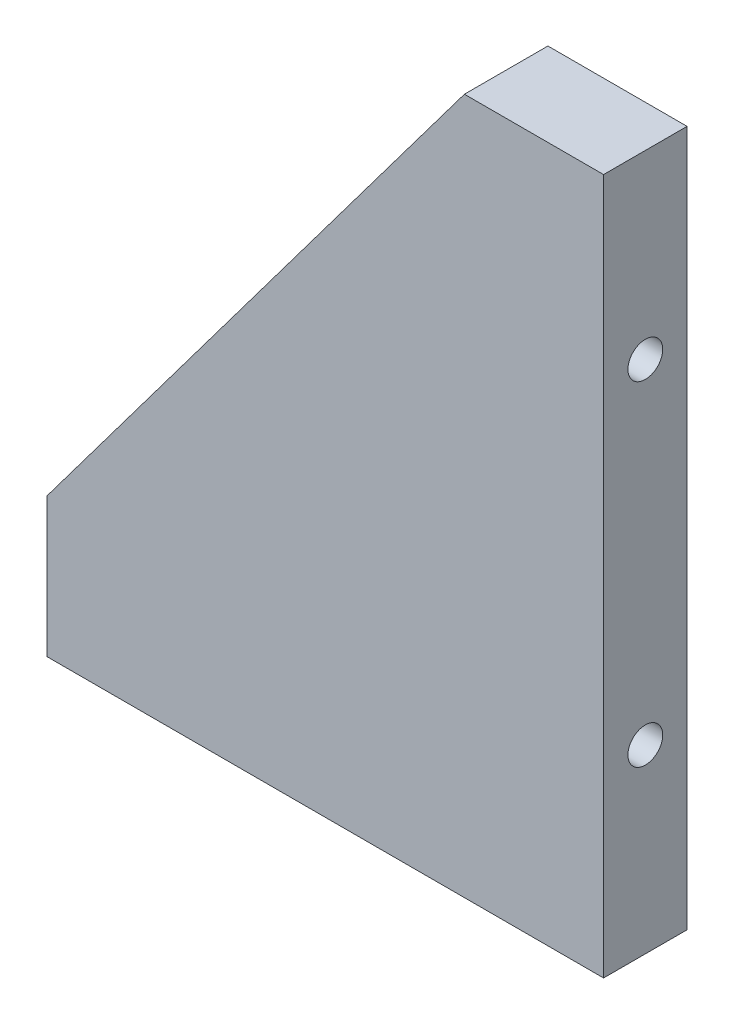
ISO-10303-21;
HEADER;
FILE_DESCRIPTION(('STEP AP214'),'2;1');
FILE_NAME('part.step','',(''),(''),'','','');
FILE_SCHEMA(('AUTOMOTIVE_DESIGN { 1 0 10303 214 1 1 1 1 }'));
ENDSEC;
DATA;
#1=APPLICATION_CONTEXT('core data for automotive mechanical design processes');
#2=APPLICATION_PROTOCOL_DEFINITION('international standard','automotive_design',2000,#1);
#3=PRODUCT_CONTEXT('',#1,'mechanical');
#4=PRODUCT('Part','Part','',(#3));
#5=PRODUCT_RELATED_PRODUCT_CATEGORY('part','',(#4));
#6=PRODUCT_DEFINITION_FORMATION('','',#4);
#7=PRODUCT_DEFINITION_CONTEXT('part definition',#1,'design');
#8=PRODUCT_DEFINITION('design','',#6,#7);
#9=PRODUCT_DEFINITION_SHAPE('','',#8);
#10=(LENGTH_UNIT() NAMED_UNIT(*) SI_UNIT(.MILLI.,.METRE.));
#11=(NAMED_UNIT(*) PLANE_ANGLE_UNIT() SI_UNIT($,.RADIAN.));
#12=(NAMED_UNIT(*) SI_UNIT($,.STERADIAN.) SOLID_ANGLE_UNIT());
#13=UNCERTAINTY_MEASURE_WITH_UNIT(LENGTH_MEASURE(1.E-05),#10,'distance_accuracy_value','');
#14=(GEOMETRIC_REPRESENTATION_CONTEXT(3) GLOBAL_UNCERTAINTY_ASSIGNED_CONTEXT((#13)) GLOBAL_UNIT_ASSIGNED_CONTEXT((#10,
#11,#12)) REPRESENTATION_CONTEXT('',''));
#15=CARTESIAN_POINT('',(0.,0.,0.));
#16=DIRECTION('',(0.,0.,1.));
#17=DIRECTION('',(1.,0.,0.));
#18=AXIS2_PLACEMENT_3D('',#15,#16,#17);
#19=CARTESIAN_POINT('',(0.,-6.34105120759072,12.));
#20=DIRECTION('',(-1.,0.,0.));
#21=DIRECTION('',(0.,0.,1.));
#22=AXIS2_PLACEMENT_3D('',#19,#20,#21);
#23=PLANE('',#22);
#24=CARTESIAN_POINT('',(0.,19.6589487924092,6.));
#25=DIRECTION('',(1.,0.,0.));
#26=DIRECTION('',(0.,0.,-1.));
#27=AXIS2_PLACEMENT_3D('',#24,#25,#26);
#28=CIRCLE('',#27,2.5);
#29=CARTESIAN_POINT('',(0.,19.6589487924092,3.5));
#30=VERTEX_POINT('',#29);
#31=EDGE_CURVE('E135',#30,#30,#28,.T.);
#32=ORIENTED_EDGE('',*,*,#31,.F.);
#33=EDGE_LOOP('',(#32));
#34=FACE_BOUND('',#33,.T.);
#35=CARTESIAN_POINT('',(0.,67.6589487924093,6.));
#36=DIRECTION('',(1.,0.,0.));
#37=DIRECTION('',(0.,0.,-1.));
#38=AXIS2_PLACEMENT_3D('',#35,#36,#37);
#39=CIRCLE('',#38,2.5);
#40=CARTESIAN_POINT('',(0.,67.6589487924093,3.5));
#41=VERTEX_POINT('',#40);
#42=EDGE_CURVE('E138',#41,#41,#39,.T.);
#43=ORIENTED_EDGE('',*,*,#42,.F.);
#44=EDGE_LOOP('',(#43));
#45=FACE_BOUND('',#44,.T.);
#46=DIRECTION('',(0.,1.,0.));
#47=VECTOR('',#46,1.);
#48=CARTESIAN_POINT('',(0.,-6.34105120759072,0.));
#49=LINE('',#48,#47);
#50=CARTESIAN_POINT('',(0.,-6.34105120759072,0.));
#51=VERTEX_POINT('',#50);
#52=CARTESIAN_POINT('',(0.,93.6589487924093,0.));
#53=VERTEX_POINT('',#52);
#54=EDGE_CURVE('E93',#51,#53,#49,.T.);
#55=ORIENTED_EDGE('',*,*,#54,.T.);
#56=DIRECTION('',(0.,0.,-1.));
#57=VECTOR('',#56,1.);
#58=CARTESIAN_POINT('',(0.,93.6589487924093,12.));
#59=LINE('',#58,#57);
#60=CARTESIAN_POINT('',(0.,93.6589487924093,12.));
#61=VERTEX_POINT('',#60);
#62=EDGE_CURVE('E11',#61,#53,#59,.T.);
#63=ORIENTED_EDGE('',*,*,#62,.F.);
#64=DIRECTION('',(0.,1.,0.));
#65=VECTOR('',#64,1.);
#66=CARTESIAN_POINT('',(0.,-6.34105120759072,12.));
#67=LINE('',#66,#65);
#68=CARTESIAN_POINT('',(0.,-6.34105120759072,12.));
#69=VERTEX_POINT('',#68);
#70=EDGE_CURVE('E102',#69,#61,#67,.T.);
#71=ORIENTED_EDGE('',*,*,#70,.F.);
#72=DIRECTION('',(0.,0.,-1.));
#73=VECTOR('',#72,1.);
#74=CARTESIAN_POINT('',(0.,-6.34105120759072,12.));
#75=LINE('',#74,#73);
#76=EDGE_CURVE('E89',#69,#51,#75,.T.);
#77=ORIENTED_EDGE('',*,*,#76,.T.);
#78=EDGE_LOOP('',(#55,#63,#71,#77));
#79=FACE_BOUND('',#78,.T.);
#80=ADVANCED_FACE('F16',(#34,#45,#79),#23,.F.);
#81=CARTESIAN_POINT('',(0.,93.6589487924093,12.));
#82=DIRECTION('',(0.,-1.,0.));
#83=DIRECTION('',(0.,0.,-1.));
#84=AXIS2_PLACEMENT_3D('',#81,#82,#83);
#85=PLANE('',#84);
#86=DIRECTION('',(-1.,0.,0.));
#87=VECTOR('',#86,1.);
#88=CARTESIAN_POINT('',(0.,93.6589487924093,0.));
#89=LINE('',#88,#87);
#90=CARTESIAN_POINT('',(-20.,93.6589487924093,0.));
#91=VERTEX_POINT('',#90);
#92=EDGE_CURVE('E96',#53,#91,#89,.T.);
#93=ORIENTED_EDGE('',*,*,#92,.T.);
#94=DIRECTION('',(0.,0.,-1.));
#95=VECTOR('',#94,1.);
#96=CARTESIAN_POINT('',(-20.,93.6589487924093,12.));
#97=LINE('',#96,#95);
#98=CARTESIAN_POINT('',(-20.,93.6589487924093,12.));
#99=VERTEX_POINT('',#98);
#100=EDGE_CURVE('E24',#99,#91,#97,.T.);
#101=ORIENTED_EDGE('',*,*,#100,.F.);
#102=DIRECTION('',(-1.,0.,0.));
#103=VECTOR('',#102,1.);
#104=CARTESIAN_POINT('',(0.,93.6589487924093,12.));
#105=LINE('',#104,#103);
#106=EDGE_CURVE('E67',#61,#99,#105,.T.);
#107=ORIENTED_EDGE('',*,*,#106,.F.);
#108=ORIENTED_EDGE('',*,*,#62,.T.);
#109=EDGE_LOOP('',(#93,#101,#107,#108));
#110=FACE_BOUND('',#109,.T.);
#111=ADVANCED_FACE('F126',(#110),#85,.F.);
#112=CARTESIAN_POINT('',(-80.,13.6589487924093,12.));
#113=DIRECTION('',(0.8,-0.6,0.));
#114=DIRECTION('',(0.6,0.8,0.));
#115=AXIS2_PLACEMENT_3D('',#112,#113,#114);
#116=PLANE('',#115);
#117=DIRECTION('',(-0.6,-0.8,0.));
#118=VECTOR('',#117,1.);
#119=CARTESIAN_POINT('',(-80.,13.6589487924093,0.));
#120=LINE('',#119,#118);
#121=CARTESIAN_POINT('',(-80.,13.6589487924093,0.));
#122=VERTEX_POINT('',#121);
#123=EDGE_CURVE('E84',#91,#122,#120,.T.);
#124=ORIENTED_EDGE('',*,*,#123,.T.);
#125=DIRECTION('',(0.,0.,-1.));
#126=VECTOR('',#125,1.);
#127=CARTESIAN_POINT('',(-80.,13.6589487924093,12.));
#128=LINE('',#127,#126);
#129=CARTESIAN_POINT('',(-80.,13.6589487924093,12.));
#130=VERTEX_POINT('',#129);
#131=EDGE_CURVE('E81',#130,#122,#128,.T.);
#132=ORIENTED_EDGE('',*,*,#131,.F.);
#133=DIRECTION('',(-0.6,-0.8,0.));
#134=VECTOR('',#133,1.);
#135=CARTESIAN_POINT('',(-80.,13.6589487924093,12.));
#136=LINE('',#135,#134);
#137=EDGE_CURVE('E73',#99,#130,#136,.T.);
#138=ORIENTED_EDGE('',*,*,#137,.F.);
#139=ORIENTED_EDGE('',*,*,#100,.T.);
#140=EDGE_LOOP('',(#124,#132,#138,#139));
#141=FACE_BOUND('',#140,.T.);
#142=ADVANCED_FACE('F82',(#141),#116,.F.);
#143=CARTESIAN_POINT('',(-80.,-6.34105120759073,12.));
#144=DIRECTION('',(1.,0.,0.));
#145=DIRECTION('',(0.,0.,-1.));
#146=AXIS2_PLACEMENT_3D('',#143,#144,#145);
#147=PLANE('',#146);
#148=DIRECTION('',(0.,-1.,0.));
#149=VECTOR('',#148,1.);
#150=CARTESIAN_POINT('',(-80.,-6.34105120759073,0.));
#151=LINE('',#150,#149);
#152=CARTESIAN_POINT('',(-80.,-6.34105120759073,0.));
#153=VERTEX_POINT('',#152);
#154=EDGE_CURVE('E53',#122,#153,#151,.T.);
#155=ORIENTED_EDGE('',*,*,#154,.T.);
#156=DIRECTION('',(0.,0.,-1.));
#157=VECTOR('',#156,1.);
#158=CARTESIAN_POINT('',(-80.,-6.34105120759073,12.));
#159=LINE('',#158,#157);
#160=CARTESIAN_POINT('',(-80.,-6.34105120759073,12.));
#161=VERTEX_POINT('',#160);
#162=EDGE_CURVE('E85',#161,#153,#159,.T.);
#163=ORIENTED_EDGE('',*,*,#162,.F.);
#164=DIRECTION('',(0.,-1.,0.));
#165=VECTOR('',#164,1.);
#166=CARTESIAN_POINT('',(-80.,-6.34105120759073,12.));
#167=LINE('',#166,#165);
#168=EDGE_CURVE('E77',#130,#161,#167,.T.);
#169=ORIENTED_EDGE('',*,*,#168,.F.);
#170=ORIENTED_EDGE('',*,*,#131,.T.);
#171=EDGE_LOOP('',(#155,#163,#169,#170));
#172=FACE_BOUND('',#171,.T.);
#173=ADVANCED_FACE('F87',(#172),#147,.F.);
#174=CARTESIAN_POINT('',(0.,-6.34105120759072,12.));
#175=DIRECTION('',(0.,1.,0.));
#176=DIRECTION('',(-1.,0.,0.));
#177=AXIS2_PLACEMENT_3D('',#174,#175,#176);
#178=PLANE('',#177);
#179=CARTESIAN_POINT('',(-16.,-6.34105120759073,6.));
#180=DIRECTION('',(0.,-1.,0.));
#181=DIRECTION('',(0.,0.,-1.));
#182=AXIS2_PLACEMENT_3D('',#179,#180,#181);
#183=CIRCLE('',#182,2.5);
#184=CARTESIAN_POINT('',(-16.,-6.34105120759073,3.5));
#185=VERTEX_POINT('',#184);
#186=EDGE_CURVE('E158',#185,#185,#183,.T.);
#187=ORIENTED_EDGE('',*,*,#186,.F.);
#188=EDGE_LOOP('',(#187));
#189=FACE_BOUND('',#188,.T.);
#190=CARTESIAN_POINT('',(-66.,-6.34105120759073,6.));
#191=DIRECTION('',(0.,-1.,0.));
#192=DIRECTION('',(0.,0.,-1.));
#193=AXIS2_PLACEMENT_3D('',#190,#191,#192);
#194=CIRCLE('',#193,2.5);
#195=CARTESIAN_POINT('',(-66.,-6.34105120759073,3.5));
#196=VERTEX_POINT('',#195);
#197=EDGE_CURVE('E152',#196,#196,#194,.T.);
#198=ORIENTED_EDGE('',*,*,#197,.F.);
#199=EDGE_LOOP('',(#198));
#200=FACE_BOUND('',#199,.T.);
#201=DIRECTION('',(1.,0.,0.));
#202=VECTOR('',#201,1.);
#203=CARTESIAN_POINT('',(0.,-6.34105120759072,0.));
#204=LINE('',#203,#202);
#205=EDGE_CURVE('E59',#153,#51,#204,.T.);
#206=ORIENTED_EDGE('',*,*,#205,.T.);
#207=ORIENTED_EDGE('',*,*,#76,.F.);
#208=DIRECTION('',(1.,0.,0.));
#209=VECTOR('',#208,1.);
#210=CARTESIAN_POINT('',(0.,-6.34105120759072,12.));
#211=LINE('',#210,#209);
#212=EDGE_CURVE('E32',#161,#69,#211,.T.);
#213=ORIENTED_EDGE('',*,*,#212,.F.);
#214=ORIENTED_EDGE('',*,*,#162,.T.);
#215=EDGE_LOOP('',(#206,#207,#213,#214));
#216=FACE_BOUND('',#215,.T.);
#217=ADVANCED_FACE('F110',(#189,#200,#216),#178,.F.);
#218=CARTESIAN_POINT('',(0.,0.,12.));
#219=DIRECTION('',(0.,0.,1.));
#220=DIRECTION('',(1.,0.,0.));
#221=AXIS2_PLACEMENT_3D('',#218,#219,#220);
#222=PLANE('',#221);
#223=ORIENTED_EDGE('',*,*,#70,.T.);
#224=ORIENTED_EDGE('',*,*,#106,.T.);
#225=ORIENTED_EDGE('',*,*,#137,.T.);
#226=ORIENTED_EDGE('',*,*,#168,.T.);
#227=ORIENTED_EDGE('',*,*,#212,.T.);
#228=EDGE_LOOP('',(#223,#224,#225,#226,#227));
#229=FACE_BOUND('',#228,.T.);
#230=ADVANCED_FACE('F75',(#229),#222,.T.);
#231=CARTESIAN_POINT('',(0.,0.,0.));
#232=DIRECTION('',(0.,0.,1.));
#233=DIRECTION('',(1.,0.,0.));
#234=AXIS2_PLACEMENT_3D('',#231,#232,#233);
#235=PLANE('',#234);
#236=ORIENTED_EDGE('',*,*,#54,.F.);
#237=ORIENTED_EDGE('',*,*,#205,.F.);
#238=ORIENTED_EDGE('',*,*,#154,.F.);
#239=ORIENTED_EDGE('',*,*,#123,.F.);
#240=ORIENTED_EDGE('',*,*,#92,.F.);
#241=EDGE_LOOP('',(#236,#237,#238,#239,#240));
#242=FACE_BOUND('',#241,.T.);
#243=ADVANCED_FACE('F106',(#242),#235,.F.);
#244=CARTESIAN_POINT('',(-17.,67.6589487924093,6.));
#245=DIRECTION('',(1.,0.,0.));
#246=DIRECTION('',(0.,0.,-1.));
#247=AXIS2_PLACEMENT_3D('',#244,#245,#246);
#248=CONICAL_SURFACE('',#247,2.5,1.02974425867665);
#249=CARTESIAN_POINT('',(-18.5021515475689,67.6589487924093,6.));
#250=VERTEX_POINT('',#249);
#251=VERTEX_LOOP('',#250);
#252=FACE_BOUND('',#251,.T.);
#253=CARTESIAN_POINT('',(-17.,67.6589487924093,6.));
#254=DIRECTION('',(1.,0.,0.));
#255=DIRECTION('',(0.,0.,-1.));
#256=AXIS2_PLACEMENT_3D('',#253,#254,#255);
#257=CIRCLE('',#256,2.5);
#258=CARTESIAN_POINT('',(-17.,67.6589487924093,3.5));
#259=VERTEX_POINT('',#258);
#260=EDGE_CURVE('E97',#259,#259,#257,.T.);
#261=ORIENTED_EDGE('',*,*,#260,.T.);
#262=EDGE_LOOP('',(#261));
#263=FACE_BOUND('',#262,.T.);
#264=ADVANCED_FACE('F193',(#252,#263),#248,.F.);
#265=CARTESIAN_POINT('',(0.,67.6589487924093,6.));
#266=DIRECTION('',(1.,0.,0.));
#267=DIRECTION('',(0.,0.,-1.));
#268=AXIS2_PLACEMENT_3D('',#265,#266,#267);
#269=CYLINDRICAL_SURFACE('',#268,2.5);
#270=ORIENTED_EDGE('',*,*,#260,.F.);
#271=EDGE_LOOP('',(#270));
#272=FACE_BOUND('',#271,.T.);
#273=ORIENTED_EDGE('',*,*,#42,.T.);
#274=EDGE_LOOP('',(#273));
#275=FACE_BOUND('',#274,.T.);
#276=ADVANCED_FACE('F189',(#272,#275),#269,.F.);
#277=CARTESIAN_POINT('',(-17.,19.6589487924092,6.));
#278=DIRECTION('',(1.,0.,0.));
#279=DIRECTION('',(0.,0.,-1.));
#280=AXIS2_PLACEMENT_3D('',#277,#278,#279);
#281=CONICAL_SURFACE('',#280,2.5,1.02974425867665);
#282=CARTESIAN_POINT('',(-18.5021515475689,19.6589487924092,6.));
#283=VERTEX_POINT('',#282);
#284=VERTEX_LOOP('',#283);
#285=FACE_BOUND('',#284,.T.);
#286=CARTESIAN_POINT('',(-17.,19.6589487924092,6.));
#287=DIRECTION('',(1.,0.,0.));
#288=DIRECTION('',(0.,0.,-1.));
#289=AXIS2_PLACEMENT_3D('',#286,#287,#288);
#290=CIRCLE('',#289,2.5);
#291=CARTESIAN_POINT('',(-17.,19.6589487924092,3.5));
#292=VERTEX_POINT('',#291);
#293=EDGE_CURVE('E140',#292,#292,#290,.T.);
#294=ORIENTED_EDGE('',*,*,#293,.T.);
#295=EDGE_LOOP('',(#294));
#296=FACE_BOUND('',#295,.T.);
#297=ADVANCED_FACE('F185',(#285,#296),#281,.F.);
#298=CARTESIAN_POINT('',(0.,19.6589487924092,6.));
#299=DIRECTION('',(1.,0.,0.));
#300=DIRECTION('',(0.,0.,-1.));
#301=AXIS2_PLACEMENT_3D('',#298,#299,#300);
#302=CYLINDRICAL_SURFACE('',#301,2.5);
#303=ORIENTED_EDGE('',*,*,#293,.F.);
#304=EDGE_LOOP('',(#303));
#305=FACE_BOUND('',#304,.T.);
#306=ORIENTED_EDGE('',*,*,#31,.T.);
#307=EDGE_LOOP('',(#306));
#308=FACE_BOUND('',#307,.T.);
#309=ADVANCED_FACE('F181',(#305,#308),#302,.F.);
#310=CARTESIAN_POINT('',(-66.,10.6589487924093,6.));
#311=DIRECTION('',(0.,-1.,0.));
#312=DIRECTION('',(0.,0.,-1.));
#313=AXIS2_PLACEMENT_3D('',#310,#311,#312);
#314=CONICAL_SURFACE('',#313,2.5,1.02974425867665);
#315=CARTESIAN_POINT('',(-66.,12.1611003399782,6.));
#316=VERTEX_POINT('',#315);
#317=VERTEX_LOOP('',#316);
#318=FACE_BOUND('',#317,.T.);
#319=CARTESIAN_POINT('',(-66.,10.6589487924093,6.));
#320=DIRECTION('',(0.,-1.,0.));
#321=DIRECTION('',(0.,0.,-1.));
#322=AXIS2_PLACEMENT_3D('',#319,#320,#321);
#323=CIRCLE('',#322,2.5);
#324=CARTESIAN_POINT('',(-66.,10.6589487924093,3.5));
#325=VERTEX_POINT('',#324);
#326=EDGE_CURVE('E149',#325,#325,#323,.T.);
#327=ORIENTED_EDGE('',*,*,#326,.T.);
#328=EDGE_LOOP('',(#327));
#329=FACE_BOUND('',#328,.T.);
#330=ADVANCED_FACE('F177',(#318,#329),#314,.F.);
#331=CARTESIAN_POINT('',(-66.,-6.34105120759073,6.));
#332=DIRECTION('',(0.,-1.,0.));
#333=DIRECTION('',(0.,0.,-1.));
#334=AXIS2_PLACEMENT_3D('',#331,#332,#333);
#335=CYLINDRICAL_SURFACE('',#334,2.5);
#336=ORIENTED_EDGE('',*,*,#326,.F.);
#337=EDGE_LOOP('',(#336));
#338=FACE_BOUND('',#337,.T.);
#339=ORIENTED_EDGE('',*,*,#197,.T.);
#340=EDGE_LOOP('',(#339));
#341=FACE_BOUND('',#340,.T.);
#342=ADVANCED_FACE('F170',(#338,#341),#335,.F.);
#343=CARTESIAN_POINT('',(-16.,10.6589487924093,6.));
#344=DIRECTION('',(0.,-1.,0.));
#345=DIRECTION('',(0.,0.,-1.));
#346=AXIS2_PLACEMENT_3D('',#343,#344,#345);
#347=CONICAL_SURFACE('',#346,2.5,1.02974425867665);
#348=CARTESIAN_POINT('',(-16.,12.1611003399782,6.));
#349=VERTEX_POINT('',#348);
#350=VERTEX_LOOP('',#349);
#351=FACE_BOUND('',#350,.T.);
#352=CARTESIAN_POINT('',(-16.,10.6589487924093,6.));
#353=DIRECTION('',(0.,-1.,0.));
#354=DIRECTION('',(0.,0.,-1.));
#355=AXIS2_PLACEMENT_3D('',#352,#353,#354);
#356=CIRCLE('',#355,2.5);
#357=CARTESIAN_POINT('',(-16.,10.6589487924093,3.5));
#358=VERTEX_POINT('',#357);
#359=EDGE_CURVE('E155',#358,#358,#356,.T.);
#360=ORIENTED_EDGE('',*,*,#359,.T.);
#361=EDGE_LOOP('',(#360));
#362=FACE_BOUND('',#361,.T.);
#363=ADVANCED_FACE('F163',(#351,#362),#347,.F.);
#364=CARTESIAN_POINT('',(-16.,-6.34105120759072,6.));
#365=DIRECTION('',(0.,-1.,0.));
#366=DIRECTION('',(0.,0.,-1.));
#367=AXIS2_PLACEMENT_3D('',#364,#365,#366);
#368=CYLINDRICAL_SURFACE('',#367,2.5);
#369=ORIENTED_EDGE('',*,*,#359,.F.);
#370=EDGE_LOOP('',(#369));
#371=FACE_BOUND('',#370,.T.);
#372=ORIENTED_EDGE('',*,*,#186,.T.);
#373=EDGE_LOOP('',(#372));
#374=FACE_BOUND('',#373,.T.);
#375=ADVANCED_FACE('F161',(#371,#374),#368,.F.);
#376=CLOSED_SHELL('',(#80,#111,#142,#173,#217,#230,#243,#264,#276,#297,#309,#330,#342,#363,#375));
#377=MANIFOLD_SOLID_BREP('B1',#376);
#378=ADVANCED_BREP_SHAPE_REPRESENTATION('',(#18,#377),#14);
#379=SHAPE_DEFINITION_REPRESENTATION(#9,#378);
ENDSEC;
END-ISO-10303-21;
